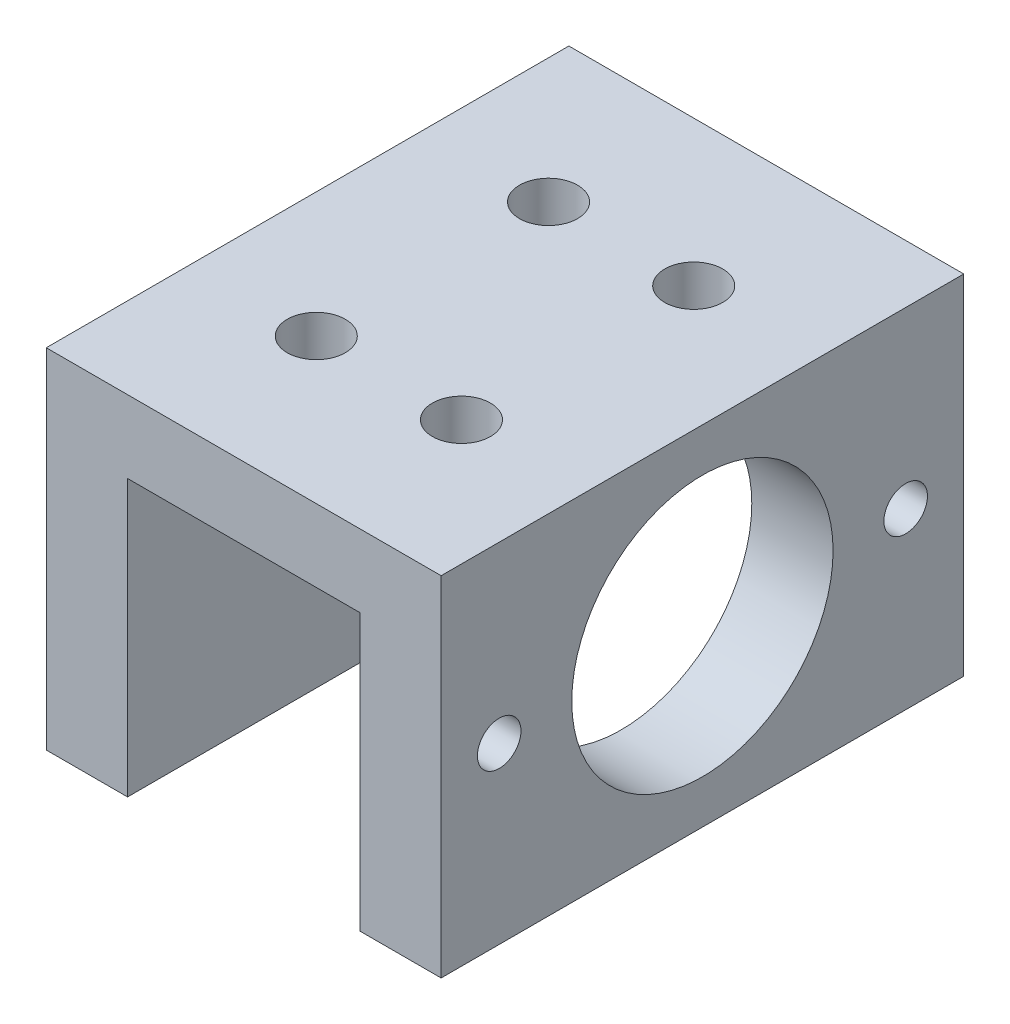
ISO-10303-21;
HEADER;
FILE_DESCRIPTION(('STEP AP214'),'2;1');
FILE_NAME('part.step','',(''),(''),'','','');
FILE_SCHEMA(('AUTOMOTIVE_DESIGN { 1 0 10303 214 1 1 1 1 }'));
ENDSEC;
DATA;
#1=APPLICATION_CONTEXT('core data for automotive mechanical design processes');
#2=APPLICATION_PROTOCOL_DEFINITION('international standard','automotive_design',2000,#1);
#3=PRODUCT_CONTEXT('',#1,'mechanical');
#4=PRODUCT('Part','Part','',(#3));
#5=PRODUCT_RELATED_PRODUCT_CATEGORY('part','',(#4));
#6=PRODUCT_DEFINITION_FORMATION('','',#4);
#7=PRODUCT_DEFINITION_CONTEXT('part definition',#1,'design');
#8=PRODUCT_DEFINITION('design','',#6,#7);
#9=PRODUCT_DEFINITION_SHAPE('','',#8);
#10=(LENGTH_UNIT() NAMED_UNIT(*) SI_UNIT(.MILLI.,.METRE.));
#11=(NAMED_UNIT(*) PLANE_ANGLE_UNIT() SI_UNIT($,.RADIAN.));
#12=(NAMED_UNIT(*) SI_UNIT($,.STERADIAN.) SOLID_ANGLE_UNIT());
#13=UNCERTAINTY_MEASURE_WITH_UNIT(LENGTH_MEASURE(1.E-05),#10,'distance_accuracy_value','');
#14=(GEOMETRIC_REPRESENTATION_CONTEXT(3) GLOBAL_UNCERTAINTY_ASSIGNED_CONTEXT((#13)) GLOBAL_UNIT_ASSIGNED_CONTEXT((#10,
#11,#12)) REPRESENTATION_CONTEXT('',''));
#15=CARTESIAN_POINT('',(0.,0.,0.));
#16=DIRECTION('',(0.,0.,1.));
#17=DIRECTION('',(1.,0.,0.));
#18=AXIS2_PLACEMENT_3D('',#15,#16,#17);
#19=CARTESIAN_POINT('',(0.,-24.,0.));
#20=DIRECTION('',(0.,1.,0.));
#21=DIRECTION('',(0.,0.,1.));
#22=AXIS2_PLACEMENT_3D('',#19,#20,#21);
#23=PLANE('',#22);
#24=DIRECTION('',(1.,0.,0.));
#25=VECTOR('',#24,1.);
#26=CARTESIAN_POINT('',(-13.6,-24.,18.));
#27=LINE('',#26,#25);
#28=CARTESIAN_POINT('',(8.,-24.,18.));
#29=VERTEX_POINT('',#28);
#30=CARTESIAN_POINT('',(13.6,-24.,18.));
#31=VERTEX_POINT('',#30);
#32=EDGE_CURVE('E145',#29,#31,#27,.T.);
#33=ORIENTED_EDGE('',*,*,#32,.F.);
#34=DIRECTION('',(0.,0.,-1.));
#35=VECTOR('',#34,1.);
#36=CARTESIAN_POINT('',(8.,-24.,18.));
#37=LINE('',#36,#35);
#38=CARTESIAN_POINT('',(8.,-24.,-18.));
#39=VERTEX_POINT('',#38);
#40=EDGE_CURVE('E155',#29,#39,#37,.T.);
#41=ORIENTED_EDGE('',*,*,#40,.T.);
#42=DIRECTION('',(-1.,0.,0.));
#43=VECTOR('',#42,1.);
#44=CARTESIAN_POINT('',(13.6,-24.,-18.));
#45=LINE('',#44,#43);
#46=CARTESIAN_POINT('',(13.6,-24.,-18.));
#47=VERTEX_POINT('',#46);
#48=EDGE_CURVE('E149',#47,#39,#45,.T.);
#49=ORIENTED_EDGE('',*,*,#48,.F.);
#50=DIRECTION('',(0.,0.,-1.));
#51=VECTOR('',#50,1.);
#52=CARTESIAN_POINT('',(13.6,-24.,18.));
#53=LINE('',#52,#51);
#54=EDGE_CURVE('E132',#31,#47,#53,.T.);
#55=ORIENTED_EDGE('',*,*,#54,.F.);
#56=EDGE_LOOP('',(#33,#41,#49,#55));
#57=FACE_BOUND('',#56,.T.);
#58=ADVANCED_FACE('F16',(#57),#23,.F.);
#59=CARTESIAN_POINT('',(13.6,-24.,18.));
#60=DIRECTION('',(1.,0.,0.));
#61=DIRECTION('',(0.,0.,-1.));
#62=AXIS2_PLACEMENT_3D('',#59,#60,#61);
#63=PLANE('',#62);
#64=CARTESIAN_POINT('',(13.6,-12.,0.));
#65=DIRECTION('',(1.,0.,0.));
#66=DIRECTION('',(0.,0.,-1.));
#67=AXIS2_PLACEMENT_3D('',#64,#65,#66);
#68=CIRCLE('',#67,9.);
#69=CARTESIAN_POINT('',(13.6,-12.,-9.));
#70=VERTEX_POINT('',#69);
#71=EDGE_CURVE('E101',#70,#70,#68,.T.);
#72=ORIENTED_EDGE('',*,*,#71,.F.);
#73=EDGE_LOOP('',(#72));
#74=FACE_BOUND('',#73,.T.);
#75=CARTESIAN_POINT('',(13.6,-12.,14.));
#76=DIRECTION('',(1.,0.,0.));
#77=DIRECTION('',(0.,0.,-1.));
#78=AXIS2_PLACEMENT_3D('',#75,#76,#77);
#79=CIRCLE('',#78,1.49999999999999);
#80=CARTESIAN_POINT('',(13.6,-12.,12.5));
#81=VERTEX_POINT('',#80);
#82=EDGE_CURVE('E187',#81,#81,#79,.T.);
#83=ORIENTED_EDGE('',*,*,#82,.F.);
#84=EDGE_LOOP('',(#83));
#85=FACE_BOUND('',#84,.T.);
#86=CARTESIAN_POINT('',(13.6,-12.,-14.));
#87=DIRECTION('',(1.,0.,0.));
#88=DIRECTION('',(0.,0.,-1.));
#89=AXIS2_PLACEMENT_3D('',#86,#87,#88);
#90=CIRCLE('',#89,1.49999999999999);
#91=CARTESIAN_POINT('',(13.6,-12.,-15.5));
#92=VERTEX_POINT('',#91);
#93=EDGE_CURVE('E181',#92,#92,#90,.T.);
#94=ORIENTED_EDGE('',*,*,#93,.F.);
#95=EDGE_LOOP('',(#94));
#96=FACE_BOUND('',#95,.T.);
#97=DIRECTION('',(0.,0.,-1.));
#98=VECTOR('',#97,1.);
#99=CARTESIAN_POINT('',(13.6,0.,18.));
#100=LINE('',#99,#98);
#101=CARTESIAN_POINT('',(13.6,0.,18.));
#102=VERTEX_POINT('',#101);
#103=CARTESIAN_POINT('',(13.6,0.,-18.));
#104=VERTEX_POINT('',#103);
#105=EDGE_CURVE('E139',#102,#104,#100,.T.);
#106=ORIENTED_EDGE('',*,*,#105,.F.);
#107=DIRECTION('',(0.,1.,0.));
#108=VECTOR('',#107,1.);
#109=CARTESIAN_POINT('',(13.6,-24.,18.));
#110=LINE('',#109,#108);
#111=EDGE_CURVE('E95',#31,#102,#110,.T.);
#112=ORIENTED_EDGE('',*,*,#111,.F.);
#113=ORIENTED_EDGE('',*,*,#54,.T.);
#114=DIRECTION('',(0.,1.,0.));
#115=VECTOR('',#114,1.);
#116=CARTESIAN_POINT('',(13.6,-24.,-18.));
#117=LINE('',#116,#115);
#118=EDGE_CURVE('E121',#47,#104,#117,.T.);
#119=ORIENTED_EDGE('',*,*,#118,.T.);
#120=EDGE_LOOP('',(#106,#112,#113,#119));
#121=FACE_BOUND('',#120,.T.);
#122=ADVANCED_FACE('F18',(#74,#85,#96,#121),#63,.T.);
#123=CARTESIAN_POINT('',(-13.6,-24.,18.));
#124=DIRECTION('',(0.,0.,1.));
#125=DIRECTION('',(1.,0.,0.));
#126=AXIS2_PLACEMENT_3D('',#123,#124,#125);
#127=PLANE('',#126);
#128=DIRECTION('',(0.,-1.,0.));
#129=VECTOR('',#128,1.);
#130=CARTESIAN_POINT('',(8.,-5.,18.));
#131=LINE('',#130,#129);
#132=CARTESIAN_POINT('',(8.,-5.,18.));
#133=VERTEX_POINT('',#132);
#134=EDGE_CURVE('E167',#133,#29,#131,.T.);
#135=ORIENTED_EDGE('',*,*,#134,.T.);
#136=ORIENTED_EDGE('',*,*,#32,.T.);
#137=ORIENTED_EDGE('',*,*,#111,.T.);
#138=DIRECTION('',(1.,0.,0.));
#139=VECTOR('',#138,1.);
#140=CARTESIAN_POINT('',(-13.6,0.,18.));
#141=LINE('',#140,#139);
#142=CARTESIAN_POINT('',(-13.6,0.,18.));
#143=VERTEX_POINT('',#142);
#144=EDGE_CURVE('E129',#143,#102,#141,.T.);
#145=ORIENTED_EDGE('',*,*,#144,.F.);
#146=DIRECTION('',(0.,1.,0.));
#147=VECTOR('',#146,1.);
#148=CARTESIAN_POINT('',(-13.6,-24.,18.));
#149=LINE('',#148,#147);
#150=CARTESIAN_POINT('',(-13.6,-24.,18.));
#151=VERTEX_POINT('',#150);
#152=EDGE_CURVE('E126',#151,#143,#149,.T.);
#153=ORIENTED_EDGE('',*,*,#152,.F.);
#154=CARTESIAN_POINT('',(-8.,-24.,18.));
#155=VERTEX_POINT('',#154);
#156=EDGE_CURVE('E124',#151,#155,#27,.T.);
#157=ORIENTED_EDGE('',*,*,#156,.T.);
#158=DIRECTION('',(0.,1.,0.));
#159=VECTOR('',#158,1.);
#160=CARTESIAN_POINT('',(-8.,-24.,18.));
#161=LINE('',#160,#159);
#162=CARTESIAN_POINT('',(-8.,-5.,18.));
#163=VERTEX_POINT('',#162);
#164=EDGE_CURVE('E38',#155,#163,#161,.T.);
#165=ORIENTED_EDGE('',*,*,#164,.T.);
#166=DIRECTION('',(1.,0.,0.));
#167=VECTOR('',#166,1.);
#168=CARTESIAN_POINT('',(-8.,-5.,18.));
#169=LINE('',#168,#167);
#170=EDGE_CURVE('E159',#163,#133,#169,.T.);
#171=ORIENTED_EDGE('',*,*,#170,.T.);
#172=EDGE_LOOP('',(#135,#136,#137,#145,#153,#157,#165,#171));
#173=FACE_BOUND('',#172,.T.);
#174=ADVANCED_FACE('F208',(#173),#127,.T.);
#175=CARTESIAN_POINT('',(-13.6,-24.,-18.));
#176=DIRECTION('',(-1.,0.,0.));
#177=DIRECTION('',(0.,0.,1.));
#178=AXIS2_PLACEMENT_3D('',#175,#176,#177);
#179=PLANE('',#178);
#180=DIRECTION('',(0.,0.,1.));
#181=VECTOR('',#180,1.);
#182=CARTESIAN_POINT('',(-13.6,0.,-18.));
#183=LINE('',#182,#181);
#184=CARTESIAN_POINT('',(-13.6,0.,-18.));
#185=VERTEX_POINT('',#184);
#186=EDGE_CURVE('E133',#185,#143,#183,.T.);
#187=ORIENTED_EDGE('',*,*,#186,.F.);
#188=DIRECTION('',(0.,1.,0.));
#189=VECTOR('',#188,1.);
#190=CARTESIAN_POINT('',(-13.6,-24.,-18.));
#191=LINE('',#190,#189);
#192=CARTESIAN_POINT('',(-13.6,-24.,-18.));
#193=VERTEX_POINT('',#192);
#194=EDGE_CURVE('E123',#193,#185,#191,.T.);
#195=ORIENTED_EDGE('',*,*,#194,.F.);
#196=DIRECTION('',(0.,0.,1.));
#197=VECTOR('',#196,1.);
#198=CARTESIAN_POINT('',(-13.6,-24.,-18.));
#199=LINE('',#198,#197);
#200=EDGE_CURVE('E146',#193,#151,#199,.T.);
#201=ORIENTED_EDGE('',*,*,#200,.T.);
#202=ORIENTED_EDGE('',*,*,#152,.T.);
#203=EDGE_LOOP('',(#187,#195,#201,#202));
#204=FACE_BOUND('',#203,.T.);
#205=ADVANCED_FACE('F235',(#204),#179,.T.);
#206=CARTESIAN_POINT('',(13.6,-24.,-18.));
#207=DIRECTION('',(0.,0.,-1.));
#208=DIRECTION('',(-1.,0.,0.));
#209=AXIS2_PLACEMENT_3D('',#206,#207,#208);
#210=PLANE('',#209);
#211=DIRECTION('',(0.,-1.,0.));
#212=VECTOR('',#211,1.);
#213=CARTESIAN_POINT('',(8.,-5.,-18.));
#214=LINE('',#213,#212);
#215=CARTESIAN_POINT('',(8.,-5.,-18.));
#216=VERTEX_POINT('',#215);
#217=EDGE_CURVE('E171',#216,#39,#214,.T.);
#218=ORIENTED_EDGE('',*,*,#217,.F.);
#219=DIRECTION('',(1.,0.,0.));
#220=VECTOR('',#219,1.);
#221=CARTESIAN_POINT('',(-8.,-5.,-18.));
#222=LINE('',#221,#220);
#223=CARTESIAN_POINT('',(-8.,-5.,-18.));
#224=VERTEX_POINT('',#223);
#225=EDGE_CURVE('E165',#224,#216,#222,.T.);
#226=ORIENTED_EDGE('',*,*,#225,.F.);
#227=DIRECTION('',(0.,1.,0.));
#228=VECTOR('',#227,1.);
#229=CARTESIAN_POINT('',(-8.,-24.,-18.));
#230=LINE('',#229,#228);
#231=CARTESIAN_POINT('',(-8.,-24.,-18.));
#232=VERTEX_POINT('',#231);
#233=EDGE_CURVE('E168',#232,#224,#230,.T.);
#234=ORIENTED_EDGE('',*,*,#233,.F.);
#235=EDGE_CURVE('E152',#232,#193,#45,.T.);
#236=ORIENTED_EDGE('',*,*,#235,.T.);
#237=ORIENTED_EDGE('',*,*,#194,.T.);
#238=DIRECTION('',(-1.,0.,0.));
#239=VECTOR('',#238,1.);
#240=CARTESIAN_POINT('',(13.6,0.,-18.));
#241=LINE('',#240,#239);
#242=EDGE_CURVE('E136',#104,#185,#241,.T.);
#243=ORIENTED_EDGE('',*,*,#242,.F.);
#244=ORIENTED_EDGE('',*,*,#118,.F.);
#245=ORIENTED_EDGE('',*,*,#48,.T.);
#246=EDGE_LOOP('',(#218,#226,#234,#236,#237,#243,#244,#245));
#247=FACE_BOUND('',#246,.T.);
#248=ADVANCED_FACE('F228',(#247),#210,.T.);
#249=ORIENTED_EDGE('',*,*,#235,.F.);
#250=DIRECTION('',(0.,0.,-1.));
#251=VECTOR('',#250,1.);
#252=CARTESIAN_POINT('',(-8.,-24.,18.));
#253=LINE('',#252,#251);
#254=EDGE_CURVE('E158',#155,#232,#253,.T.);
#255=ORIENTED_EDGE('',*,*,#254,.F.);
#256=ORIENTED_EDGE('',*,*,#156,.F.);
#257=ORIENTED_EDGE('',*,*,#200,.F.);
#258=EDGE_LOOP('',(#249,#255,#256,#257));
#259=FACE_BOUND('',#258,.T.);
#260=ADVANCED_FACE('F238',(#259),#23,.F.);
#261=CARTESIAN_POINT('',(0.,0.,0.));
#262=DIRECTION('',(0.,1.,0.));
#263=DIRECTION('',(0.,0.,1.));
#264=AXIS2_PLACEMENT_3D('',#261,#262,#263);
#265=PLANE('',#264);
#266=CARTESIAN_POINT('',(5.,0.,8.));
#267=DIRECTION('',(0.,1.,0.));
#268=DIRECTION('',(0.,0.,1.));
#269=AXIS2_PLACEMENT_3D('',#266,#267,#268);
#270=CIRCLE('',#269,2.);
#271=CARTESIAN_POINT('',(5.,0.,10.));
#272=VERTEX_POINT('',#271);
#273=EDGE_CURVE('E112',#272,#272,#270,.T.);
#274=ORIENTED_EDGE('',*,*,#273,.F.);
#275=EDGE_LOOP('',(#274));
#276=FACE_BOUND('',#275,.T.);
#277=CARTESIAN_POINT('',(-5.,0.,8.));
#278=DIRECTION('',(0.,1.,0.));
#279=DIRECTION('',(0.,0.,1.));
#280=AXIS2_PLACEMENT_3D('',#277,#278,#279);
#281=CIRCLE('',#280,2.);
#282=CARTESIAN_POINT('',(-5.,0.,10.));
#283=VERTEX_POINT('',#282);
#284=EDGE_CURVE('E111',#283,#283,#281,.T.);
#285=ORIENTED_EDGE('',*,*,#284,.F.);
#286=EDGE_LOOP('',(#285));
#287=FACE_BOUND('',#286,.T.);
#288=CARTESIAN_POINT('',(-5.,0.,-8.));
#289=DIRECTION('',(0.,1.,0.));
#290=DIRECTION('',(0.,0.,1.));
#291=AXIS2_PLACEMENT_3D('',#288,#289,#290);
#292=CIRCLE('',#291,2.);
#293=CARTESIAN_POINT('',(-5.,0.,-6.));
#294=VERTEX_POINT('',#293);
#295=EDGE_CURVE('E116',#294,#294,#292,.T.);
#296=ORIENTED_EDGE('',*,*,#295,.F.);
#297=EDGE_LOOP('',(#296));
#298=FACE_BOUND('',#297,.T.);
#299=CARTESIAN_POINT('',(5.,0.,-8.));
#300=DIRECTION('',(0.,1.,0.));
#301=DIRECTION('',(0.,0.,1.));
#302=AXIS2_PLACEMENT_3D('',#299,#300,#301);
#303=CIRCLE('',#302,2.);
#304=CARTESIAN_POINT('',(5.,0.,-6.));
#305=VERTEX_POINT('',#304);
#306=EDGE_CURVE('E120',#305,#305,#303,.T.);
#307=ORIENTED_EDGE('',*,*,#306,.F.);
#308=EDGE_LOOP('',(#307));
#309=FACE_BOUND('',#308,.T.);
#310=ORIENTED_EDGE('',*,*,#105,.T.);
#311=ORIENTED_EDGE('',*,*,#242,.T.);
#312=ORIENTED_EDGE('',*,*,#186,.T.);
#313=ORIENTED_EDGE('',*,*,#144,.T.);
#314=EDGE_LOOP('',(#310,#311,#312,#313));
#315=FACE_BOUND('',#314,.T.);
#316=ADVANCED_FACE('F219',(#276,#287,#298,#309,#315),#265,.T.);
#317=CARTESIAN_POINT('',(8.,-5.,18.));
#318=DIRECTION('',(1.,0.,0.));
#319=DIRECTION('',(0.,0.,-1.));
#320=AXIS2_PLACEMENT_3D('',#317,#318,#319);
#321=PLANE('',#320);
#322=CARTESIAN_POINT('',(8.,-12.,14.));
#323=DIRECTION('',(1.,0.,0.));
#324=DIRECTION('',(0.,0.,-1.));
#325=AXIS2_PLACEMENT_3D('',#322,#323,#324);
#326=CIRCLE('',#325,1.5);
#327=CARTESIAN_POINT('',(8.,-12.,12.5));
#328=VERTEX_POINT('',#327);
#329=EDGE_CURVE('E184',#328,#328,#326,.T.);
#330=ORIENTED_EDGE('',*,*,#329,.T.);
#331=EDGE_LOOP('',(#330));
#332=FACE_BOUND('',#331,.T.);
#333=CARTESIAN_POINT('',(8.,-12.,-14.));
#334=DIRECTION('',(1.,0.,0.));
#335=DIRECTION('',(0.,0.,-1.));
#336=AXIS2_PLACEMENT_3D('',#333,#334,#335);
#337=CIRCLE('',#336,1.5);
#338=CARTESIAN_POINT('',(8.,-12.,-15.5));
#339=VERTEX_POINT('',#338);
#340=EDGE_CURVE('E173',#339,#339,#337,.T.);
#341=ORIENTED_EDGE('',*,*,#340,.T.);
#342=EDGE_LOOP('',(#341));
#343=FACE_BOUND('',#342,.T.);
#344=DIRECTION('',(0.,0.,-1.));
#345=VECTOR('',#344,1.);
#346=CARTESIAN_POINT('',(8.,-5.,18.));
#347=LINE('',#346,#345);
#348=CARTESIAN_POINT('',(8.,-5.,5.65685424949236));
#349=VERTEX_POINT('',#348);
#350=EDGE_CURVE('E142',#133,#349,#347,.T.);
#351=ORIENTED_EDGE('',*,*,#350,.T.);
#352=CARTESIAN_POINT('',(8.,-12.,0.));
#353=DIRECTION('',(1.,0.,0.));
#354=DIRECTION('',(0.,0.,-1.));
#355=AXIS2_PLACEMENT_3D('',#352,#353,#354);
#356=CIRCLE('',#355,9.);
#357=CARTESIAN_POINT('',(8.,-5.,-5.65685424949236));
#358=VERTEX_POINT('',#357);
#359=EDGE_CURVE('E100',#349,#358,#356,.T.);
#360=ORIENTED_EDGE('',*,*,#359,.T.);
#361=EDGE_CURVE('E106',#358,#216,#347,.T.);
#362=ORIENTED_EDGE('',*,*,#361,.T.);
#363=ORIENTED_EDGE('',*,*,#217,.T.);
#364=ORIENTED_EDGE('',*,*,#40,.F.);
#365=ORIENTED_EDGE('',*,*,#134,.F.);
#366=EDGE_LOOP('',(#351,#360,#362,#363,#364,#365));
#367=FACE_BOUND('',#366,.T.);
#368=ADVANCED_FACE('F241',(#332,#343,#367),#321,.F.);
#369=CARTESIAN_POINT('',(-8.,-5.,18.));
#370=DIRECTION('',(0.,1.,0.));
#371=DIRECTION('',(0.,0.,1.));
#372=AXIS2_PLACEMENT_3D('',#369,#370,#371);
#373=PLANE('',#372);
#374=CARTESIAN_POINT('',(5.,-5.,8.));
#375=DIRECTION('',(0.,1.,0.));
#376=DIRECTION('',(0.,0.,1.));
#377=AXIS2_PLACEMENT_3D('',#374,#375,#376);
#378=CIRCLE('',#377,2.);
#379=CARTESIAN_POINT('',(5.,-5.,10.));
#380=VERTEX_POINT('',#379);
#381=EDGE_CURVE('E108',#380,#380,#378,.T.);
#382=ORIENTED_EDGE('',*,*,#381,.T.);
#383=EDGE_LOOP('',(#382));
#384=FACE_BOUND('',#383,.T.);
#385=CARTESIAN_POINT('',(-5.,-5.,8.));
#386=DIRECTION('',(0.,1.,0.));
#387=DIRECTION('',(0.,0.,1.));
#388=AXIS2_PLACEMENT_3D('',#385,#386,#387);
#389=CIRCLE('',#388,2.);
#390=CARTESIAN_POINT('',(-5.,-5.,10.));
#391=VERTEX_POINT('',#390);
#392=EDGE_CURVE('E113',#391,#391,#389,.T.);
#393=ORIENTED_EDGE('',*,*,#392,.T.);
#394=EDGE_LOOP('',(#393));
#395=FACE_BOUND('',#394,.T.);
#396=CARTESIAN_POINT('',(-5.,-5.,-8.));
#397=DIRECTION('',(0.,1.,0.));
#398=DIRECTION('',(0.,0.,1.));
#399=AXIS2_PLACEMENT_3D('',#396,#397,#398);
#400=CIRCLE('',#399,2.);
#401=CARTESIAN_POINT('',(-5.,-5.,-6.));
#402=VERTEX_POINT('',#401);
#403=EDGE_CURVE('E117',#402,#402,#400,.T.);
#404=ORIENTED_EDGE('',*,*,#403,.T.);
#405=EDGE_LOOP('',(#404));
#406=FACE_BOUND('',#405,.T.);
#407=CARTESIAN_POINT('',(5.,-5.,-8.));
#408=DIRECTION('',(0.,1.,0.));
#409=DIRECTION('',(0.,0.,1.));
#410=AXIS2_PLACEMENT_3D('',#407,#408,#409);
#411=CIRCLE('',#410,2.);
#412=CARTESIAN_POINT('',(5.,-5.,-6.));
#413=VERTEX_POINT('',#412);
#414=EDGE_CURVE('E190',#413,#413,#411,.T.);
#415=ORIENTED_EDGE('',*,*,#414,.T.);
#416=EDGE_LOOP('',(#415));
#417=FACE_BOUND('',#416,.T.);
#418=DIRECTION('',(0.,0.,1.));
#419=VECTOR('',#418,1.);
#420=CARTESIAN_POINT('',(6.6,-5.,18.));
#421=LINE('',#420,#419);
#422=CARTESIAN_POINT('',(6.6,-5.,-5.65685424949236));
#423=VERTEX_POINT('',#422);
#424=CARTESIAN_POINT('',(6.6,-5.,5.65685424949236));
#425=VERTEX_POINT('',#424);
#426=EDGE_CURVE('E91',#423,#425,#421,.T.);
#427=ORIENTED_EDGE('',*,*,#426,.T.);
#428=DIRECTION('',(1.,0.,0.));
#429=VECTOR('',#428,1.);
#430=CARTESIAN_POINT('',(13.6,-5.,5.65685424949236));
#431=LINE('',#430,#429);
#432=EDGE_CURVE('E10',#425,#349,#431,.T.);
#433=ORIENTED_EDGE('',*,*,#432,.T.);
#434=ORIENTED_EDGE('',*,*,#350,.F.);
#435=ORIENTED_EDGE('',*,*,#170,.F.);
#436=DIRECTION('',(0.,0.,-1.));
#437=VECTOR('',#436,1.);
#438=CARTESIAN_POINT('',(-8.,-5.,18.));
#439=LINE('',#438,#437);
#440=EDGE_CURVE('E161',#163,#224,#439,.T.);
#441=ORIENTED_EDGE('',*,*,#440,.T.);
#442=ORIENTED_EDGE('',*,*,#225,.T.);
#443=ORIENTED_EDGE('',*,*,#361,.F.);
#444=DIRECTION('',(1.,0.,0.));
#445=VECTOR('',#444,1.);
#446=CARTESIAN_POINT('',(13.6,-5.,-5.65685424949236));
#447=LINE('',#446,#445);
#448=EDGE_CURVE('E24',#358,#423,#447,.F.);
#449=ORIENTED_EDGE('',*,*,#448,.T.);
#450=EDGE_LOOP('',(#427,#433,#434,#435,#441,#442,#443,#449));
#451=FACE_BOUND('',#450,.T.);
#452=ADVANCED_FACE('F104',(#384,#395,#406,#417,#451),#373,.F.);
#453=CARTESIAN_POINT('',(-8.,-24.,18.));
#454=DIRECTION('',(-1.,0.,0.));
#455=DIRECTION('',(0.,0.,1.));
#456=AXIS2_PLACEMENT_3D('',#453,#454,#455);
#457=PLANE('',#456);
#458=ORIENTED_EDGE('',*,*,#233,.T.);
#459=ORIENTED_EDGE('',*,*,#440,.F.);
#460=ORIENTED_EDGE('',*,*,#164,.F.);
#461=ORIENTED_EDGE('',*,*,#254,.T.);
#462=EDGE_LOOP('',(#458,#459,#460,#461));
#463=FACE_BOUND('',#462,.T.);
#464=ADVANCED_FACE('F242',(#463),#457,.F.);
#465=CARTESIAN_POINT('',(13.6,-12.,-14.));
#466=DIRECTION('',(1.,0.,0.));
#467=DIRECTION('',(0.,0.,-1.));
#468=AXIS2_PLACEMENT_3D('',#465,#466,#467);
#469=CYLINDRICAL_SURFACE('',#468,1.5);
#470=ORIENTED_EDGE('',*,*,#340,.F.);
#471=EDGE_LOOP('',(#470));
#472=FACE_BOUND('',#471,.T.);
#473=ORIENTED_EDGE('',*,*,#93,.T.);
#474=EDGE_LOOP('',(#473));
#475=FACE_BOUND('',#474,.T.);
#476=ADVANCED_FACE('F244',(#472,#475),#469,.F.);
#477=CARTESIAN_POINT('',(13.6,-12.,14.));
#478=DIRECTION('',(1.,0.,0.));
#479=DIRECTION('',(0.,0.,-1.));
#480=AXIS2_PLACEMENT_3D('',#477,#478,#479);
#481=CYLINDRICAL_SURFACE('',#480,1.5);
#482=ORIENTED_EDGE('',*,*,#329,.F.);
#483=EDGE_LOOP('',(#482));
#484=FACE_BOUND('',#483,.T.);
#485=ORIENTED_EDGE('',*,*,#82,.T.);
#486=EDGE_LOOP('',(#485));
#487=FACE_BOUND('',#486,.T.);
#488=ADVANCED_FACE('F252',(#484,#487),#481,.F.);
#489=CARTESIAN_POINT('',(5.,0.,-8.));
#490=DIRECTION('',(0.,1.,0.));
#491=DIRECTION('',(0.,0.,1.));
#492=AXIS2_PLACEMENT_3D('',#489,#490,#491);
#493=CYLINDRICAL_SURFACE('',#492,2.);
#494=ORIENTED_EDGE('',*,*,#306,.T.);
#495=EDGE_LOOP('',(#494));
#496=FACE_BOUND('',#495,.T.);
#497=ORIENTED_EDGE('',*,*,#414,.F.);
#498=EDGE_LOOP('',(#497));
#499=FACE_BOUND('',#498,.T.);
#500=ADVANCED_FACE('F318',(#496,#499),#493,.F.);
#501=CARTESIAN_POINT('',(-5.,0.,-8.));
#502=DIRECTION('',(0.,1.,0.));
#503=DIRECTION('',(0.,0.,1.));
#504=AXIS2_PLACEMENT_3D('',#501,#502,#503);
#505=CYLINDRICAL_SURFACE('',#504,2.);
#506=ORIENTED_EDGE('',*,*,#295,.T.);
#507=EDGE_LOOP('',(#506));
#508=FACE_BOUND('',#507,.T.);
#509=ORIENTED_EDGE('',*,*,#403,.F.);
#510=EDGE_LOOP('',(#509));
#511=FACE_BOUND('',#510,.T.);
#512=ADVANCED_FACE('F326',(#508,#511),#505,.F.);
#513=CARTESIAN_POINT('',(-5.,0.,8.));
#514=DIRECTION('',(0.,1.,0.));
#515=DIRECTION('',(0.,0.,1.));
#516=AXIS2_PLACEMENT_3D('',#513,#514,#515);
#517=CYLINDRICAL_SURFACE('',#516,2.);
#518=ORIENTED_EDGE('',*,*,#284,.T.);
#519=EDGE_LOOP('',(#518));
#520=FACE_BOUND('',#519,.T.);
#521=ORIENTED_EDGE('',*,*,#392,.F.);
#522=EDGE_LOOP('',(#521));
#523=FACE_BOUND('',#522,.T.);
#524=ADVANCED_FACE('F334',(#520,#523),#517,.F.);
#525=CARTESIAN_POINT('',(5.,0.,8.));
#526=DIRECTION('',(0.,1.,0.));
#527=DIRECTION('',(0.,0.,1.));
#528=AXIS2_PLACEMENT_3D('',#525,#526,#527);
#529=CYLINDRICAL_SURFACE('',#528,2.);
#530=ORIENTED_EDGE('',*,*,#273,.T.);
#531=EDGE_LOOP('',(#530));
#532=FACE_BOUND('',#531,.T.);
#533=ORIENTED_EDGE('',*,*,#381,.F.);
#534=EDGE_LOOP('',(#533));
#535=FACE_BOUND('',#534,.T.);
#536=ADVANCED_FACE('F342',(#532,#535),#529,.F.);
#537=CARTESIAN_POINT('',(13.6,-12.,0.));
#538=DIRECTION('',(1.,0.,0.));
#539=DIRECTION('',(0.,0.,-1.));
#540=AXIS2_PLACEMENT_3D('',#537,#538,#539);
#541=CYLINDRICAL_SURFACE('',#540,9.);
#542=ORIENTED_EDGE('',*,*,#71,.T.);
#543=EDGE_LOOP('',(#542));
#544=FACE_BOUND('',#543,.T.);
#545=CARTESIAN_POINT('',(6.6,-12.,0.));
#546=DIRECTION('',(1.,0.,0.));
#547=DIRECTION('',(0.,0.,-1.));
#548=AXIS2_PLACEMENT_3D('',#545,#546,#547);
#549=CIRCLE('',#548,9.);
#550=EDGE_CURVE('E30',#423,#425,#549,.T.);
#551=ORIENTED_EDGE('',*,*,#550,.F.);
#552=ORIENTED_EDGE('',*,*,#448,.F.);
#553=ORIENTED_EDGE('',*,*,#359,.F.);
#554=ORIENTED_EDGE('',*,*,#432,.F.);
#555=EDGE_LOOP('',(#551,#552,#553,#554));
#556=FACE_BOUND('',#555,.T.);
#557=ADVANCED_FACE('F98',(#544,#556),#541,.F.);
#558=CARTESIAN_POINT('',(6.6,-12.,0.));
#559=DIRECTION('',(-1.,0.,0.));
#560=DIRECTION('',(0.,0.,1.));
#561=AXIS2_PLACEMENT_3D('',#558,#559,#560);
#562=PLANE('',#561);
#563=ORIENTED_EDGE('',*,*,#550,.T.);
#564=ORIENTED_EDGE('',*,*,#426,.F.);
#565=EDGE_LOOP('',(#563,#564));
#566=FACE_BOUND('',#565,.T.);
#567=ADVANCED_FACE('F92',(#566),#562,.F.);
#568=CLOSED_SHELL('',(#58,#122,#174,#205,#248,#260,#316,#368,#452,#464,#476,#488,#500,#512,#524,
#536,#557,#567));
#569=MANIFOLD_SOLID_BREP('B1',#568);
#570=ADVANCED_BREP_SHAPE_REPRESENTATION('',(#18,#569),#14);
#571=SHAPE_DEFINITION_REPRESENTATION(#9,#570);
ENDSEC;
END-ISO-10303-21;
